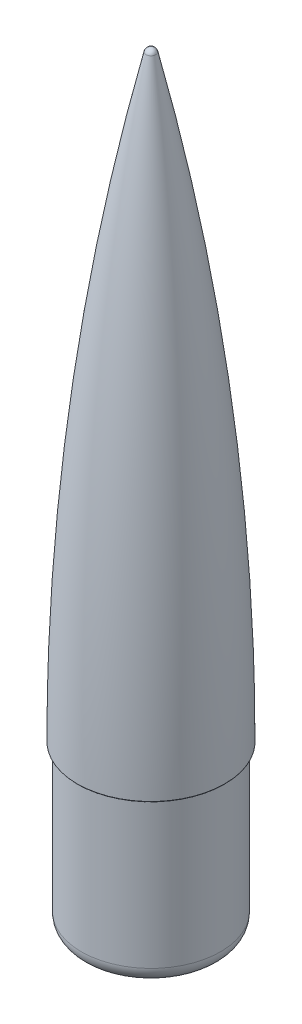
from build123d import *

# Parameters (mm, degrees)
FILLET1_R = 0.254


with BuildPart() as part:
    # Sketch1 → Revolve1 (revolve)
    with BuildSketch(Plane.XY, mode=Mode.PRIVATE) as revolve1_sk:
        with BuildLine():
            ThreePointArc((1.924990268, 233.178356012), (1.228988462, 234.278204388), (0, 234.706774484))
            Line((0, 234.706774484), (0, 228.92183248))
            ThreePointArc((0, 228.92183248), (0.699491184, 228.677685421), (1.095135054, 228.051297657))
            ThreePointArc((1.095135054, 228.051297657), (16.473970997, 146.551744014), (25.1206, 64.065856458))
            Line((25.1206, 64.065856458), (25.1206, 0))
            Line((25.1206, 0), (25.1206, -9.163900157))
            Line((25.1206, -9.163900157), (25.1206, -54.954879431))
            ThreePointArc((25.1206, -54.954879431), (23.212951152, -59.560351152), (18.607479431, -61.468))
            Line((18.607479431, -61.468), (2.845557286, -61.468))
            Line((2.845557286, -61.468), (2.845557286, -63.5))
            Line((2.845557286, -63.5), (20.861370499, -63.5))
            ThreePointArc((20.861370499, -63.5), (25.309941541, -61.657341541), (27.1526, -57.208770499))
            Line((27.1526, -57.208770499), (27.1526, 0))
            Line((27.1526, 0), (28.702, 0))
            ThreePointArc((28.702, 0), (21.985822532, 117.355393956), (1.924990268, 233.178356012))
        make_face()
    revolve(revolve1_sk.sketch.rotate(Axis((0, 241.3, 0), (0, -1, 0)), 90), axis=Axis((0, 241.3, 0), (0, -1, 0)))

    # Fillet1
    fillet1_edges = [part.edges().sort_by_distance(p)[0] for p in [
        (0, 0, -28.702),
    ]]
    fillet(fillet1_edges, radius=FILLET1_R)


solid = part.part
